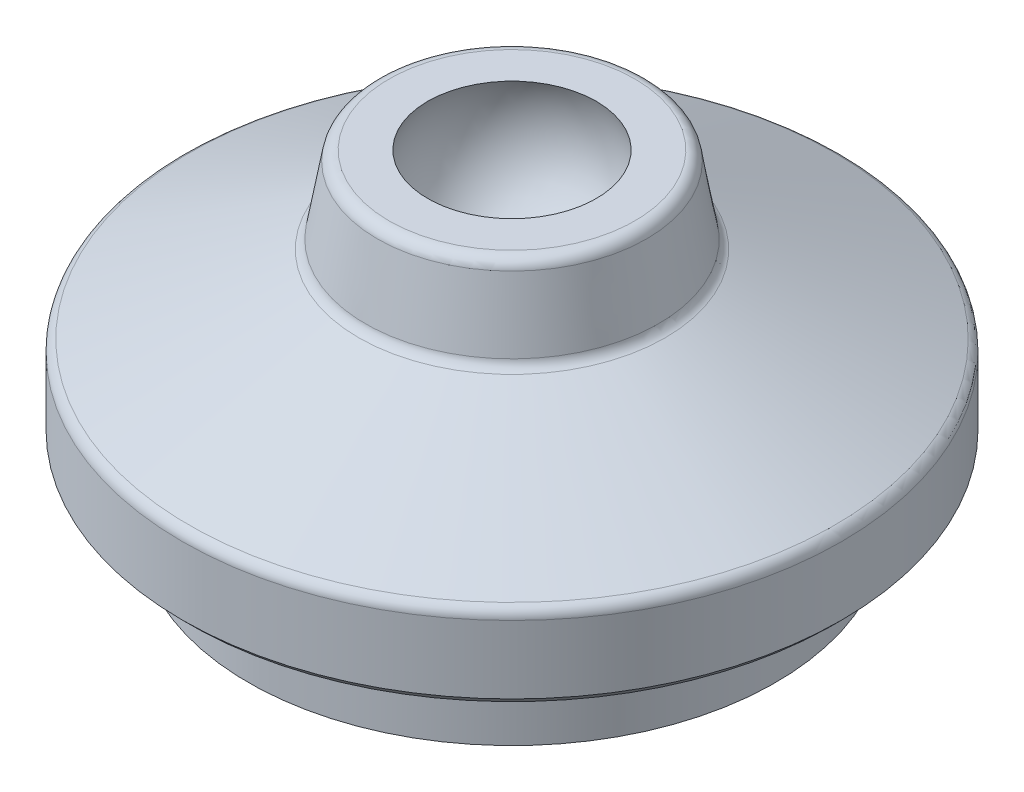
ISO-10303-21;
HEADER;
FILE_DESCRIPTION(('STEP AP214'),'2;1');
FILE_NAME('part.step','',(''),(''),'','','');
FILE_SCHEMA(('AUTOMOTIVE_DESIGN { 1 0 10303 214 1 1 1 1 }'));
ENDSEC;
DATA;
#1=APPLICATION_CONTEXT('core data for automotive mechanical design processes');
#2=APPLICATION_PROTOCOL_DEFINITION('international standard','automotive_design',2000,#1);
#3=PRODUCT_CONTEXT('',#1,'mechanical');
#4=PRODUCT('Part','Part','',(#3));
#5=PRODUCT_RELATED_PRODUCT_CATEGORY('part','',(#4));
#6=PRODUCT_DEFINITION_FORMATION('','',#4);
#7=PRODUCT_DEFINITION_CONTEXT('part definition',#1,'design');
#8=PRODUCT_DEFINITION('design','',#6,#7);
#9=PRODUCT_DEFINITION_SHAPE('','',#8);
#10=(LENGTH_UNIT() NAMED_UNIT(*) SI_UNIT(.MILLI.,.METRE.));
#11=(NAMED_UNIT(*) PLANE_ANGLE_UNIT() SI_UNIT($,.RADIAN.));
#12=(NAMED_UNIT(*) SI_UNIT($,.STERADIAN.) SOLID_ANGLE_UNIT());
#13=UNCERTAINTY_MEASURE_WITH_UNIT(LENGTH_MEASURE(1.E-05),#10,'distance_accuracy_value','');
#14=(GEOMETRIC_REPRESENTATION_CONTEXT(3) GLOBAL_UNCERTAINTY_ASSIGNED_CONTEXT((#13)) GLOBAL_UNIT_ASSIGNED_CONTEXT((#10,
#11,#12)) REPRESENTATION_CONTEXT('',''));
#15=CARTESIAN_POINT('',(0.,0.,0.));
#16=DIRECTION('',(0.,0.,1.));
#17=DIRECTION('',(1.,0.,0.));
#18=AXIS2_PLACEMENT_3D('',#15,#16,#17);
#19=CARTESIAN_POINT('',(0.,16.15,0.));
#20=DIRECTION('',(0.,-1.,0.));
#21=DIRECTION('',(-1.,0.,0.));
#22=AXIS2_PLACEMENT_3D('',#19,#20,#21);
#23=SPHERICAL_SURFACE('',#22,7.);
#24=CARTESIAN_POINT('',(0.,19.,0.));
#25=DIRECTION('',(0.,-1.,0.));
#26=DIRECTION('',(0.,0.,-1.));
#27=AXIS2_PLACEMENT_3D('',#24,#25,#26);
#28=CIRCLE('',#27,6.39355143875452);
#29=CARTESIAN_POINT('',(0.,19.,-6.39355143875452));
#30=VERTEX_POINT('',#29);
#31=EDGE_CURVE('E9',#30,#30,#28,.T.);
#32=ORIENTED_EDGE('',*,*,#31,.F.);
#33=EDGE_LOOP('',(#32));
#34=FACE_BOUND('',#33,.T.);
#35=ADVANCED_FACE('F14',(#34),#23,.F.);
#36=CARTESIAN_POINT('',(6.39355143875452,19.,0.));
#37=DIRECTION('',(0.,-1.,0.));
#38=DIRECTION('',(0.,0.,-1.));
#39=AXIS2_PLACEMENT_3D('',#36,#37,#38);
#40=PLANE('',#39);
#41=CARTESIAN_POINT('',(0.,19.,0.));
#42=DIRECTION('',(0.,-1.,0.));
#43=DIRECTION('',(0.,0.,-1.));
#44=AXIS2_PLACEMENT_3D('',#41,#42,#43);
#45=CIRCLE('',#44,9.3280727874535);
#46=CARTESIAN_POINT('',(0.,19.,-9.3280727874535));
#47=VERTEX_POINT('',#46);
#48=EDGE_CURVE('E20',#47,#47,#45,.T.);
#49=ORIENTED_EDGE('',*,*,#48,.F.);
#50=EDGE_LOOP('',(#49));
#51=FACE_BOUND('',#50,.T.);
#52=ORIENTED_EDGE('',*,*,#31,.T.);
#53=EDGE_LOOP('',(#52));
#54=FACE_BOUND('',#53,.T.);
#55=ADVANCED_FACE('F95',(#51,#54),#40,.F.);
#56=CARTESIAN_POINT('',(0.,18.1,0.));
#57=DIRECTION('',(0.,-1.,0.));
#58=DIRECTION('',(0.,0.,-1.));
#59=AXIS2_PLACEMENT_3D('',#56,#57,#58);
#60=TOROIDAL_SURFACE('',#59,9.32807278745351,0.9);
#61=ORIENTED_EDGE('',*,*,#48,.T.);
#62=EDGE_LOOP('',(#61));
#63=FACE_BOUND('',#62,.T.);
#64=CARTESIAN_POINT('',(0.,18.2562833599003,0.));
#65=DIRECTION('',(0.,-1.,0.));
#66=DIRECTION('',(0.,0.,-1.));
#67=AXIS2_PLACEMENT_3D('',#64,#65,#66);
#68=CIRCLE('',#67,10.2143997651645);
#69=CARTESIAN_POINT('',(0.,18.2562833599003,-10.2143997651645));
#70=VERTEX_POINT('',#69);
#71=EDGE_CURVE('E24',#70,#70,#68,.T.);
#72=ORIENTED_EDGE('',*,*,#71,.F.);
#73=EDGE_LOOP('',(#72));
#74=FACE_BOUND('',#73,.T.);
#75=ADVANCED_FACE('F101',(#63,#74),#60,.T.);
#76=CARTESIAN_POINT('',(0.,18.2562833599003,0.));
#77=DIRECTION('',(0.,-1.,0.));
#78=DIRECTION('',(0.,0.,-1.));
#79=AXIS2_PLACEMENT_3D('',#76,#77,#78);
#80=CONICAL_SURFACE('',#79,10.2143997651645,0.174532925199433);
#81=CARTESIAN_POINT('',(0.,13.1314843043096,0.));
#82=DIRECTION('',(0.,-1.,0.));
#83=DIRECTION('',(0.,0.,-1.));
#84=AXIS2_PLACEMENT_3D('',#81,#82,#83);
#85=CIRCLE('',#84,11.1180401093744);
#86=CARTESIAN_POINT('',(0.,13.1314843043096,-11.1180401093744));
#87=VERTEX_POINT('',#86);
#88=EDGE_CURVE('E28',#87,#87,#85,.T.);
#89=ORIENTED_EDGE('',*,*,#88,.F.);
#90=EDGE_LOOP('',(#89));
#91=FACE_BOUND('',#90,.T.);
#92=ORIENTED_EDGE('',*,*,#71,.T.);
#93=EDGE_LOOP('',(#92));
#94=FACE_BOUND('',#93,.T.);
#95=ADVANCED_FACE('F107',(#91,#94),#80,.T.);
#96=CARTESIAN_POINT('',(0.,13.2877676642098,0.));
#97=DIRECTION('',(0.,-1.,0.));
#98=DIRECTION('',(0.,0.,-1.));
#99=AXIS2_PLACEMENT_3D('',#96,#97,#98);
#100=TOROIDAL_SURFACE('',#99,12.0043670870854,0.9);
#101=CARTESIAN_POINT('',(0.,12.4697965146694,0.));
#102=DIRECTION('',(0.,-1.,0.));
#103=DIRECTION('',(0.,0.,-1.));
#104=AXIS2_PLACEMENT_3D('',#101,#102,#103);
#105=CIRCLE('',#104,11.6289696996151);
#106=CARTESIAN_POINT('',(0.,12.4697965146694,-11.6289696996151));
#107=VERTEX_POINT('',#106);
#108=EDGE_CURVE('E33',#107,#107,#105,.T.);
#109=ORIENTED_EDGE('',*,*,#108,.F.);
#110=EDGE_LOOP('',(#109));
#111=FACE_BOUND('',#110,.T.);
#112=ORIENTED_EDGE('',*,*,#88,.T.);
#113=EDGE_LOOP('',(#112));
#114=FACE_BOUND('',#113,.T.);
#115=ADVANCED_FACE('F91',(#111,#114),#100,.F.);
#116=CARTESIAN_POINT('',(0.,12.4697965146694,0.));
#117=DIRECTION('',(0.,-1.,0.));
#118=DIRECTION('',(0.,0.,-1.));
#119=AXIS2_PLACEMENT_3D('',#116,#117,#118);
#120=CONICAL_SURFACE('',#119,11.6289696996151,1.14053512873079);
#121=CARTESIAN_POINT('',(0.,6.5740929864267,0.));
#122=DIRECTION('',(0.,-1.,0.));
#123=DIRECTION('',(0.,0.,-1.));
#124=AXIS2_PLACEMENT_3D('',#121,#122,#123);
#125=CIRCLE('',#124,24.4753973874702);
#126=CARTESIAN_POINT('',(0.,6.5740929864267,-24.4753973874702));
#127=VERTEX_POINT('',#126);
#128=EDGE_CURVE('E36',#127,#127,#125,.T.);
#129=ORIENTED_EDGE('',*,*,#128,.F.);
#130=EDGE_LOOP('',(#129));
#131=FACE_BOUND('',#130,.T.);
#132=ORIENTED_EDGE('',*,*,#108,.T.);
#133=EDGE_LOOP('',(#132));
#134=FACE_BOUND('',#133,.T.);
#135=ADVANCED_FACE('F83',(#131,#134),#120,.T.);
#136=CARTESIAN_POINT('',(0.,5.75612183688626,0.));
#137=DIRECTION('',(0.,-1.,0.));
#138=DIRECTION('',(0.,0.,-1.));
#139=AXIS2_PLACEMENT_3D('',#136,#137,#138);
#140=TOROIDAL_SURFACE('',#139,24.1,0.899999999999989);
#141=ORIENTED_EDGE('',*,*,#128,.T.);
#142=EDGE_LOOP('',(#141));
#143=FACE_BOUND('',#142,.T.);
#144=CARTESIAN_POINT('',(0.,5.75612183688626,0.));
#145=DIRECTION('',(0.,-1.,0.));
#146=DIRECTION('',(0.,0.,-1.));
#147=AXIS2_PLACEMENT_3D('',#144,#145,#146);
#148=CIRCLE('',#147,25.);
#149=CARTESIAN_POINT('',(0.,5.75612183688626,-25.));
#150=VERTEX_POINT('',#149);
#151=EDGE_CURVE('E39',#150,#150,#148,.T.);
#152=ORIENTED_EDGE('',*,*,#151,.F.);
#153=EDGE_LOOP('',(#152));
#154=FACE_BOUND('',#153,.T.);
#155=ADVANCED_FACE('F78',(#143,#154),#140,.T.);
#156=CARTESIAN_POINT('',(0.,-6.,0.));
#157=DIRECTION('',(0.,-1.,0.));
#158=DIRECTION('',(0.,0.,-1.));
#159=AXIS2_PLACEMENT_3D('',#156,#157,#158);
#160=CYLINDRICAL_SURFACE('',#159,25.);
#161=CARTESIAN_POINT('',(0.,0.6,0.));
#162=DIRECTION('',(0.,-1.,0.));
#163=DIRECTION('',(0.,0.,-1.));
#164=AXIS2_PLACEMENT_3D('',#161,#162,#163);
#165=CIRCLE('',#164,25.);
#166=CARTESIAN_POINT('',(0.,0.6,-25.));
#167=VERTEX_POINT('',#166);
#168=EDGE_CURVE('E42',#167,#167,#165,.T.);
#169=ORIENTED_EDGE('',*,*,#168,.F.);
#170=EDGE_LOOP('',(#169));
#171=FACE_BOUND('',#170,.T.);
#172=ORIENTED_EDGE('',*,*,#151,.T.);
#173=EDGE_LOOP('',(#172));
#174=FACE_BOUND('',#173,.T.);
#175=ADVANCED_FACE('F72',(#171,#174),#160,.T.);
#176=CARTESIAN_POINT('',(0.,0.6,0.));
#177=DIRECTION('',(0.,1.,0.));
#178=DIRECTION('',(0.,0.,1.));
#179=AXIS2_PLACEMENT_3D('',#176,#177,#178);
#180=CONICAL_SURFACE('',#179,25.,0.78539816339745);
#181=CARTESIAN_POINT('',(0.,0.,0.));
#182=DIRECTION('',(0.,-1.,0.));
#183=DIRECTION('',(0.,0.,-1.));
#184=AXIS2_PLACEMENT_3D('',#181,#182,#183);
#185=CIRCLE('',#184,24.4);
#186=CARTESIAN_POINT('',(0.,0.,-24.4));
#187=VERTEX_POINT('',#186);
#188=EDGE_CURVE('E45',#187,#187,#185,.T.);
#189=ORIENTED_EDGE('',*,*,#188,.F.);
#190=EDGE_LOOP('',(#189));
#191=FACE_BOUND('',#190,.T.);
#192=ORIENTED_EDGE('',*,*,#168,.T.);
#193=EDGE_LOOP('',(#192));
#194=FACE_BOUND('',#193,.T.);
#195=ADVANCED_FACE('F66',(#191,#194),#180,.T.);
#196=CARTESIAN_POINT('',(24.4,0.,0.));
#197=DIRECTION('',(0.,1.,0.));
#198=DIRECTION('',(0.,0.,1.));
#199=AXIS2_PLACEMENT_3D('',#196,#197,#198);
#200=PLANE('',#199);
#201=CARTESIAN_POINT('',(0.,0.,0.));
#202=DIRECTION('',(0.,-1.,0.));
#203=DIRECTION('',(0.,0.,-1.));
#204=AXIS2_PLACEMENT_3D('',#201,#202,#203);
#205=CIRCLE('',#204,20.);
#206=CARTESIAN_POINT('',(0.,0.,-20.));
#207=VERTEX_POINT('',#206);
#208=EDGE_CURVE('E48',#207,#207,#205,.T.);
#209=ORIENTED_EDGE('',*,*,#208,.F.);
#210=EDGE_LOOP('',(#209));
#211=FACE_BOUND('',#210,.T.);
#212=ORIENTED_EDGE('',*,*,#188,.T.);
#213=EDGE_LOOP('',(#212));
#214=FACE_BOUND('',#213,.T.);
#215=ADVANCED_FACE('F60',(#211,#214),#200,.F.);
#216=CARTESIAN_POINT('',(0.,-6.,0.));
#217=DIRECTION('',(0.,-1.,0.));
#218=DIRECTION('',(0.,0.,-1.));
#219=AXIS2_PLACEMENT_3D('',#216,#217,#218);
#220=CYLINDRICAL_SURFACE('',#219,20.);
#221=CARTESIAN_POINT('',(0.,-6.,0.));
#222=DIRECTION('',(0.,-1.,0.));
#223=DIRECTION('',(0.,0.,-1.));
#224=AXIS2_PLACEMENT_3D('',#221,#222,#223);
#225=CIRCLE('',#224,20.);
#226=CARTESIAN_POINT('',(0.,-6.,-20.));
#227=VERTEX_POINT('',#226);
#228=EDGE_CURVE('E51',#227,#227,#225,.T.);
#229=ORIENTED_EDGE('',*,*,#228,.F.);
#230=EDGE_LOOP('',(#229));
#231=FACE_BOUND('',#230,.T.);
#232=ORIENTED_EDGE('',*,*,#208,.T.);
#233=EDGE_LOOP('',(#232));
#234=FACE_BOUND('',#233,.T.);
#235=ADVANCED_FACE('F57',(#231,#234),#220,.T.);
#236=CARTESIAN_POINT('',(20.,-6.,0.));
#237=DIRECTION('',(0.,1.,0.));
#238=DIRECTION('',(0.,0.,1.));
#239=AXIS2_PLACEMENT_3D('',#236,#237,#238);
#240=PLANE('',#239);
#241=ORIENTED_EDGE('',*,*,#228,.T.);
#242=EDGE_LOOP('',(#241));
#243=FACE_BOUND('',#242,.T.);
#244=ADVANCED_FACE('F55',(#243),#240,.F.);
#245=CLOSED_SHELL('',(#35,#55,#75,#95,#115,#135,#155,#175,#195,#215,#235,#244));
#246=MANIFOLD_SOLID_BREP('B1',#245);
#247=ADVANCED_BREP_SHAPE_REPRESENTATION('',(#18,#246),#14);
#248=SHAPE_DEFINITION_REPRESENTATION(#9,#247);
ENDSEC;
END-ISO-10303-21;
